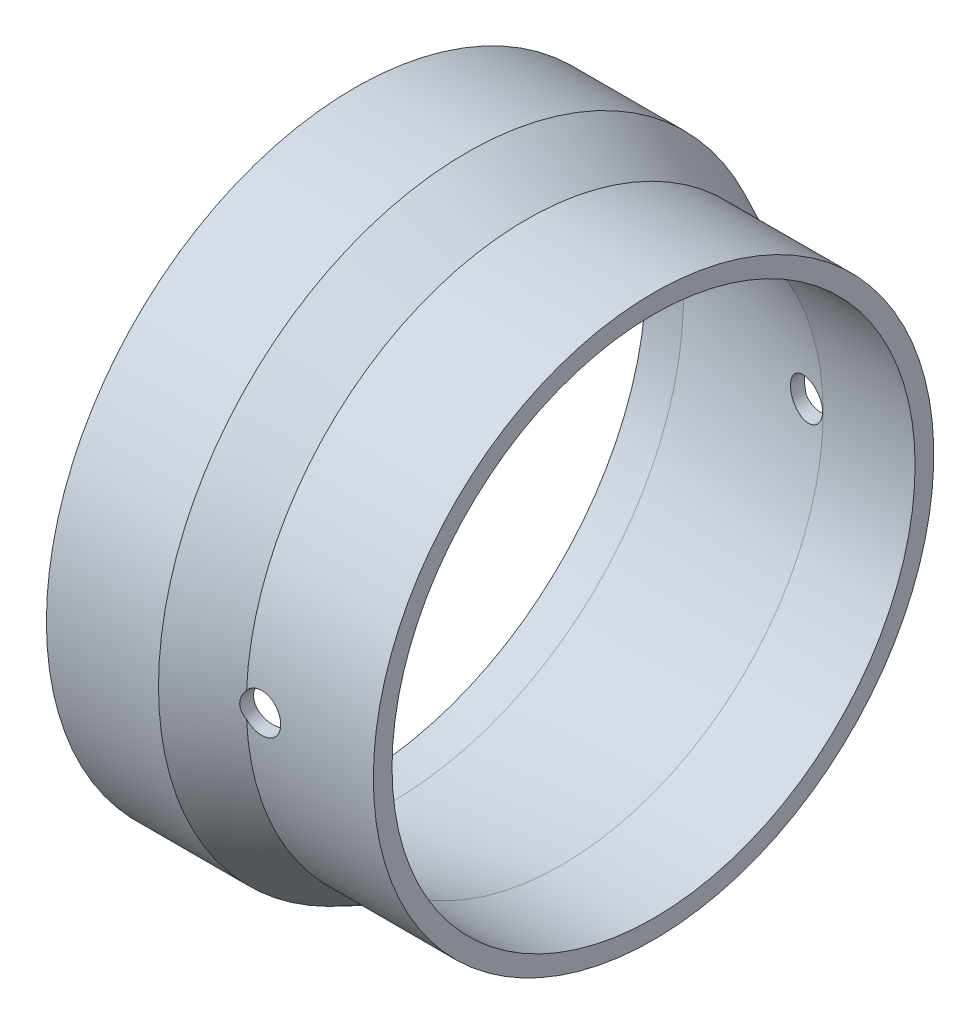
from build123d import *

# Parameters (mm, degrees)
CUT_EXTRUDE1_DEPTH      = 45.915310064
CUT_EXTRUDE1_DEPTH_BACK = 45.915310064
SKETCH2_R               = 1.651


with BuildPart() as part:
    # Sketch1 → Revolve1 (revolve)
    with BuildSketch(Plane.XY, mode=Mode.PRIVATE) as revolve1_sk:
        Polygon((0, 26.19375), (0, 24.765), (3.175, 24.765), (17.580055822, 22.225), (25.4, 22.225), (25.4, 23.8125), (14.605, 23.8125), (9.525, 26.19375), align=None)
    revolve(revolve1_sk.sketch.rotate(Axis((-26.372546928, 0, 0), (1, 0, 0)), 90), axis=Axis((-26.372546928, 0, 0), (1, 0, 0)))

    # Sketch2 → Cut-Extrude1 (cut, two sides: drawn at the far end of the back side and taken through both)
    with BuildSketch(Plane.XY.offset(-CUT_EXTRUDE1_DEPTH_BACK)):
        with Locations(Location((15.875, 0, 0), (0, 0, 140.284862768))):
            Circle(SKETCH2_R)
    extrude(amount=CUT_EXTRUDE1_DEPTH + CUT_EXTRUDE1_DEPTH_BACK, mode=Mode.SUBTRACT)


solid = part.part
